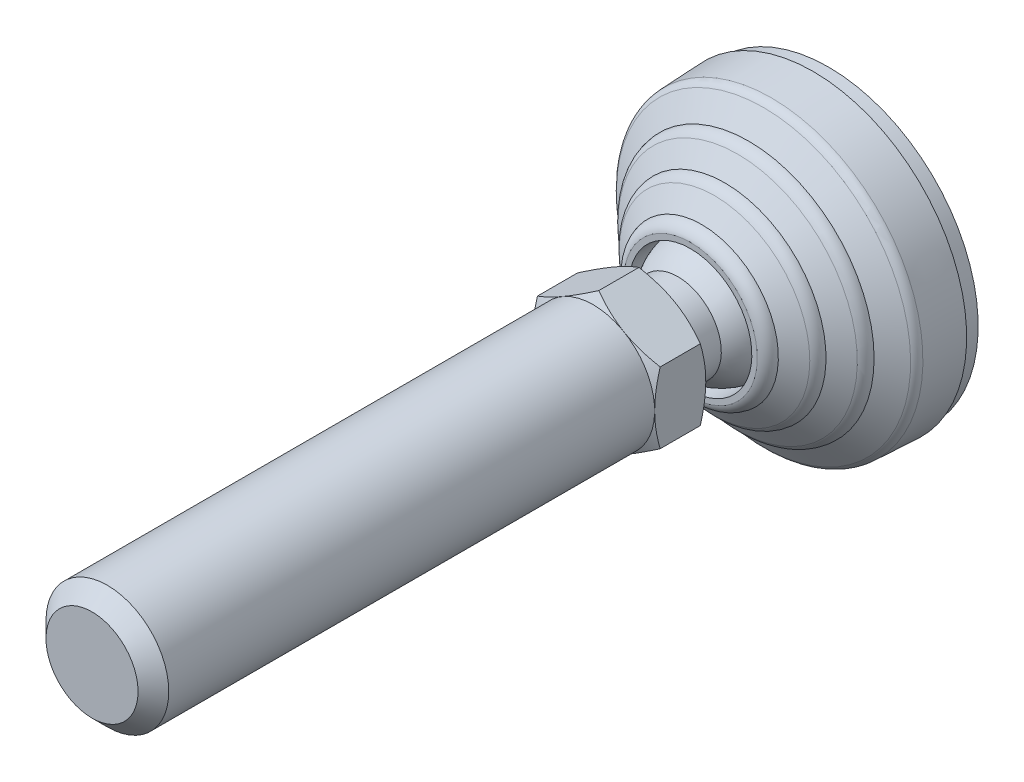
ISO-10303-21;
HEADER;
FILE_DESCRIPTION(('STEP AP214'),'2;1');
FILE_NAME('part.step','',(''),(''),'','','');
FILE_SCHEMA(('AUTOMOTIVE_DESIGN { 1 0 10303 214 1 1 1 1 }'));
ENDSEC;
DATA;
#1=APPLICATION_CONTEXT('core data for automotive mechanical design processes');
#2=APPLICATION_PROTOCOL_DEFINITION('international standard','automotive_design',2000,#1);
#3=PRODUCT_CONTEXT('',#1,'mechanical');
#4=PRODUCT('Part','Part','',(#3));
#5=PRODUCT_RELATED_PRODUCT_CATEGORY('part','',(#4));
#6=PRODUCT_DEFINITION_FORMATION('','',#4);
#7=PRODUCT_DEFINITION_CONTEXT('part definition',#1,'design');
#8=PRODUCT_DEFINITION('design','',#6,#7);
#9=PRODUCT_DEFINITION_SHAPE('','',#8);
#10=(LENGTH_UNIT() NAMED_UNIT(*) SI_UNIT(.MILLI.,.METRE.));
#11=(NAMED_UNIT(*) PLANE_ANGLE_UNIT() SI_UNIT($,.RADIAN.));
#12=(NAMED_UNIT(*) SI_UNIT($,.STERADIAN.) SOLID_ANGLE_UNIT());
#13=UNCERTAINTY_MEASURE_WITH_UNIT(LENGTH_MEASURE(1.E-05),#10,'distance_accuracy_value','');
#14=(GEOMETRIC_REPRESENTATION_CONTEXT(3) GLOBAL_UNCERTAINTY_ASSIGNED_CONTEXT((#13)) GLOBAL_UNIT_ASSIGNED_CONTEXT((#10,
#11,#12)) REPRESENTATION_CONTEXT('',''));
#15=CARTESIAN_POINT('',(0.,0.,0.));
#16=DIRECTION('',(0.,0.,1.));
#17=DIRECTION('',(1.,0.,0.));
#18=AXIS2_PLACEMENT_3D('',#15,#16,#17);
#19=CARTESIAN_POINT('',(0.,0.,93.1595));
#20=DIRECTION('',(0.,0.,-1.));
#21=DIRECTION('',(0.,1.,0.));
#22=AXIS2_PLACEMENT_3D('',#19,#20,#21);
#23=CYLINDRICAL_SURFACE('',#22,12.);
#24=CARTESIAN_POINT('',(0.,0.,141.));
#25=DIRECTION('',(0.,0.,1.));
#26=DIRECTION('',(0.,-1.,0.));
#27=AXIS2_PLACEMENT_3D('',#24,#25,#26);
#28=CIRCLE('',#27,12.);
#29=CARTESIAN_POINT('',(0.,-12.,141.));
#30=VERTEX_POINT('',#29);
#31=EDGE_CURVE('E9',#30,#30,#28,.F.);
#32=ORIENTED_EDGE('',*,*,#31,.T.);
#33=EDGE_LOOP('',(#32));
#34=FACE_BOUND('',#33,.T.);
#35=CARTESIAN_POINT('',(0.,0.,46.));
#36=DIRECTION('',(0.,0.,-1.));
#37=DIRECTION('',(0.,1.,0.));
#38=AXIS2_PLACEMENT_3D('',#35,#36,#37);
#39=CIRCLE('',#38,12.);
#40=CARTESIAN_POINT('',(0.,12.,46.));
#41=VERTEX_POINT('',#40);
#42=EDGE_CURVE('E124',#41,#41,#39,.F.);
#43=ORIENTED_EDGE('',*,*,#42,.T.);
#44=EDGE_LOOP('',(#43));
#45=FACE_BOUND('',#44,.T.);
#46=ADVANCED_FACE('F14',(#34,#45),#23,.T.);
#47=CARTESIAN_POINT('',(11.995,0.,46.));
#48=DIRECTION('',(0.,0.,-1.));
#49=DIRECTION('',(0.,1.,0.));
#50=AXIS2_PLACEMENT_3D('',#47,#48,#49);
#51=PLANE('',#50);
#52=CARTESIAN_POINT('',(0.,0.,46.));
#53=DIRECTION('',(0.,0.,-1.));
#54=DIRECTION('',(0.,1.,0.));
#55=AXIS2_PLACEMENT_3D('',#52,#53,#54);
#56=CIRCLE('',#55,11.99);
#57=CARTESIAN_POINT('',(0.,11.99,46.));
#58=VERTEX_POINT('',#57);
#59=EDGE_CURVE('E132',#58,#58,#56,.F.);
#60=ORIENTED_EDGE('',*,*,#59,.T.);
#61=EDGE_LOOP('',(#60));
#62=FACE_BOUND('',#61,.T.);
#63=ORIENTED_EDGE('',*,*,#42,.F.);
#64=EDGE_LOOP('',(#63));
#65=FACE_BOUND('',#64,.T.);
#66=ADVANCED_FACE('F157',(#62,#65),#51,.T.);
#67=CARTESIAN_POINT('',(0.,0.,44.9159643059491));
#68=DIRECTION('',(0.,0.,-1.));
#69=DIRECTION('',(0.,1.,0.));
#70=AXIS2_PLACEMENT_3D('',#67,#68,#69);
#71=CONICAL_SURFACE('',#70,13.8676048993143,1.0471975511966);
#72=ORIENTED_EDGE('',*,*,#59,.F.);
#73=EDGE_LOOP('',(#72));
#74=FACE_BOUND('',#73,.T.);
#75=CARTESIAN_POINT('',(-2.88482840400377E-08,-13.8564064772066,44.9224297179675));
#76=CARTESIAN_POINT('',(0.263784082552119,-13.7041106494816,45.010340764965));
#77=CARTESIAN_POINT('',(0.528551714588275,-13.5512469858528,45.0942615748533));
#78=CARTESIAN_POINT('',(1.06021019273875,-13.2442938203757,45.2530155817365));
#79=CARTESIAN_POINT('',(1.32710170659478,-13.0902039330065,45.3278457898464));
#80=CARTESIAN_POINT('',(2.13207647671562,-12.6254515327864,45.537252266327));
#81=CARTESIAN_POINT('',(2.67333741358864,-12.3129543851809,45.6563603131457));
#82=CARTESIAN_POINT('',(3.48330954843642,-11.8453167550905,45.796023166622));
#83=CARTESIAN_POINT('',(3.74960108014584,-11.6915732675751,45.8358073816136));
#84=CARTESIAN_POINT('',(4.28341699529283,-11.3833745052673,45.9025217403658));
#85=CARTESIAN_POINT('',(4.55094140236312,-11.2289192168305,45.9294516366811));
#86=CARTESIAN_POINT('',(5.08643614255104,-10.9197511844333,45.9697675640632));
#87=CARTESIAN_POINT('',(5.35440556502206,-10.7650389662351,45.9831696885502));
#88=CARTESIAN_POINT('',(5.8905925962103,-10.4554712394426,45.996144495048));
#89=CARTESIAN_POINT('',(6.15881019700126,-10.3006157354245,45.9957176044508));
#90=CARTESIAN_POINT('',(6.66023029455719,-10.0111207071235,45.9820002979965));
#91=CARTESIAN_POINT('',(6.89346857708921,-9.87646052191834,45.97038309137));
#92=CARTESIAN_POINT('',(7.35940867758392,-9.60744987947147,45.9369099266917));
#93=CARTESIAN_POINT('',(7.59211045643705,-9.47309944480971,45.9150532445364));
#94=CARTESIAN_POINT('',(8.05685109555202,-9.20478131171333,45.8614821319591));
#95=CARTESIAN_POINT('',(8.28888924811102,-9.07081402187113,45.8297595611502));
#96=CARTESIAN_POINT('',(8.75187776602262,-8.80350747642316,45.7570131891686));
#97=CARTESIAN_POINT('',(8.98282805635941,-8.67016826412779,45.7159887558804));
#98=CARTESIAN_POINT('',(9.68388987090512,-8.26541003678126,45.5779256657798));
#99=CARTESIAN_POINT('',(10.1519713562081,-7.99516306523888,45.4671213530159));
#100=CARTESIAN_POINT('',(11.081155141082,-7.45869855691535,45.2156417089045));
#101=CARTESIAN_POINT('',(11.5422693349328,-7.19247415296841,45.075025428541));
#102=CARTESIAN_POINT('',(11.9999999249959,-6.92820327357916,44.922429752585));
#103=B_SPLINE_CURVE_WITH_KNOTS('',3,(#75,#76,#77,#78,#79,#80,#81,#82,#83,#84,#85,#86,#87,#88,
#89,#90,#91,#92,#93,#94,#95,#96,#97,#98,#99,#100,#101,#102),.UNSPECIFIED.,.F.,.F.,(4,2,2,2,2,2,
2,2,2,2,2,2,2,4),(0.,0.950996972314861,1.90230578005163,3.80897261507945,4.73890631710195,
5.6688579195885,6.59770188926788,7.52651715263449,8.33503482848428,9.14360968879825,
9.95285348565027,10.7621522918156,12.4163368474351,14.0672749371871),.UNSPECIFIED.);
#104=CARTESIAN_POINT('',(-1.44241383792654E-08,-13.8564064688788,44.9224297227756));
#105=VERTEX_POINT('',#104);
#106=CARTESIAN_POINT('',(12.,-6.92820324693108,44.9224297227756));
#107=VERTEX_POINT('',#106);
#108=EDGE_CURVE('E143',#105,#107,#103,.T.);
#109=ORIENTED_EDGE('',*,*,#108,.T.);
#110=CARTESIAN_POINT('',(12.,-6.92820326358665,44.9224297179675));
#111=CARTESIAN_POINT('',(12.,-6.64374493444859,45.0045333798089));
#112=CARTESIAN_POINT('',(12.,-6.35829458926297,45.0831531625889));
#113=CARTESIAN_POINT('',(12.,-5.78524260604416,45.2325348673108));
#114=CARTESIAN_POINT('',(12.,-5.49764024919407,45.3032940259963));
#115=CARTESIAN_POINT('',(12.,-4.63053083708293,45.5026195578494));
#116=CARTESIAN_POINT('',(12.,-4.04782834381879,45.6179071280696));
#117=CARTESIAN_POINT('',(12.,-3.17548925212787,45.7575170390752));
#118=CARTESIAN_POINT('',(12.,-2.88840964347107,45.7982045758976));
#119=CARTESIAN_POINT('',(12.,-2.31290718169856,45.8685767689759));
#120=CARTESIAN_POINT('',(12.,-2.02448443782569,45.8982623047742));
#121=CARTESIAN_POINT('',(12.,-1.44696804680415,45.9459902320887));
#122=CARTESIAN_POINT('',(12.,-1.15787537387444,45.9640443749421));
#123=CARTESIAN_POINT('',(12.,-0.579188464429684,45.9881624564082));
#124=CARTESIAN_POINT('',(12.,-0.289594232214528,45.994226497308));
#125=CARTESIAN_POINT('',(12.,0.289594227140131,45.9942264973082));
#126=CARTESIAN_POINT('',(12.,0.579188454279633,45.9881624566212));
#127=CARTESIAN_POINT('',(12.,1.15787535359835,45.9640443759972));
#128=CARTESIAN_POINT('',(12.,1.44696802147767,45.9459902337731));
#129=CARTESIAN_POINT('',(12.,2.02448440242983,45.8982623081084));
#130=CARTESIAN_POINT('',(12.,2.31290714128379,45.8685767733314));
#131=CARTESIAN_POINT('',(12.,2.88840959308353,45.798204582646));
#132=CARTESIAN_POINT('',(12.,3.17548919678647,45.7575170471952));
#133=CARTESIAN_POINT('',(12.,4.04782827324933,45.6179071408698));
#134=CARTESIAN_POINT('',(12.,4.63053075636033,45.5026195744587));
#135=CARTESIAN_POINT('',(12.,5.49764015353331,45.3032940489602));
#136=CARTESIAN_POINT('',(12.,5.78524250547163,45.2325348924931));
#137=CARTESIAN_POINT('',(12.,6.35829447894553,45.0831531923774));
#138=CARTESIAN_POINT('',(12.,6.64374481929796,45.004533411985));
#139=CARTESIAN_POINT('',(12.,6.92820314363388,44.9224297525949));
#140=B_SPLINE_CURVE_WITH_KNOTS('',3,(#110,#111,#112,#113,#114,#115,#116,#117,#118,#119,#120,
#121,#122,#123,#124,#125,#126,#127,#128,#129,#130,#131,#132,#133,#134,#135,#136,#137,#138,#139),
.UNSPECIFIED.,.F.,.F.,(4,2,2,2,2,2,2,2,2,2,2,2,2,2,4),(0.,0.888148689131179,1.77660860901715,
3.55698615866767,4.42666281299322,5.2962699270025,6.16499708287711,7.03371682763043,
7.90243655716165,8.7711636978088,9.64077079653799,10.5104474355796,12.2908249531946,
13.1792848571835,14.0674335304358),.UNSPECIFIED.);
#141=CARTESIAN_POINT('',(12.0000000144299,6.92820322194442,44.9224297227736));
#142=VERTEX_POINT('',#141);
#143=EDGE_CURVE('E135',#107,#142,#140,.T.);
#144=ORIENTED_EDGE('',*,*,#143,.T.);
#145=CARTESIAN_POINT('',(12.0000000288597,6.92820321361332,44.9224297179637));
#146=CARTESIAN_POINT('',(11.7362159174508,7.08049904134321,45.0103407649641));
#147=CARTESIAN_POINT('',(11.4714482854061,7.23336270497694,45.0942615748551));
#148=CARTESIAN_POINT('',(10.9397898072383,7.54031587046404,45.2530155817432));
#149=CARTESIAN_POINT('',(10.6728982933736,7.69440575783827,45.3278457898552));
#150=CARTESIAN_POINT('',(9.86792352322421,8.15915815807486,45.5372522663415));
#151=CARTESIAN_POINT('',(9.32666258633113,8.47165530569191,45.6563603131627));
#152=CARTESIAN_POINT('',(8.51669045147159,8.93929293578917,45.7960231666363));
#153=CARTESIAN_POINT('',(8.25039891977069,9.0930364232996,45.8358073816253));
#154=CARTESIAN_POINT('',(7.71658300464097,9.40123518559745,45.9025217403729));
#155=CARTESIAN_POINT('',(7.44905859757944,9.55569047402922,45.9294516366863));
#156=CARTESIAN_POINT('',(6.91356385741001,9.86485850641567,45.9697675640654));
#157=CARTESIAN_POINT('',(6.64559443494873,10.0195707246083,45.9831696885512));
#158=CARTESIAN_POINT('',(6.10940740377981,10.3291384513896,45.996144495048));
#159=CARTESIAN_POINT('',(5.84118980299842,10.4839939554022,45.9957176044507));
#160=CARTESIAN_POINT('',(5.33976970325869,10.773488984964,45.9820002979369));
#161=CARTESIAN_POINT('',(5.10653141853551,10.9081491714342,45.970383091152));
#162=CARTESIAN_POINT('',(4.64059131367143,11.1771598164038,45.9369099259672));
#163=CARTESIAN_POINT('',(4.4078895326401,11.3115102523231,45.9150532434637));
#164=CARTESIAN_POINT('',(3.94314888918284,11.5798283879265,45.8614821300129));
#165=CARTESIAN_POINT('',(3.71111073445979,11.7137956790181,45.8297595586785));
#166=CARTESIAN_POINT('',(3.24812221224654,11.9811022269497,45.7570131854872));
#167=CARTESIAN_POINT('',(3.01717191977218,12.1144414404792,45.7159887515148));
#168=CARTESIAN_POINT('',(2.31611009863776,12.5191996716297,45.5779256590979));
#169=CARTESIAN_POINT('',(1.84802860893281,12.7894466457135,45.4671213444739));
#170=CARTESIAN_POINT('',(0.918844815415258,13.3259111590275,45.2156416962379));
#171=CARTESIAN_POINT('',(0.457730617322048,13.5921355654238,45.0750254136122));
#172=CARTESIAN_POINT('',(2.30778996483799E-08,13.856406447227,44.9224297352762));
#173=B_SPLINE_CURVE_WITH_KNOTS('',3,(#145,#146,#147,#148,#149,#150,#151,#152,#153,#154,#155,
#156,#157,#158,#159,#160,#161,#162,#163,#164,#165,#166,#167,#168,#169,#170,#171,#172),
.UNSPECIFIED.,.F.,.F.,(4,2,2,2,2,2,2,2,2,2,2,2,2,4),(0.,0.95099697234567,1.9023057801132,
3.8089726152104,4.73890631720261,5.66885791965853,6.59770188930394,7.52651715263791,
8.33503483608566,9.14360970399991,9.95285350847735,10.7621523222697,12.4163368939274,
14.0672749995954),.UNSPECIFIED.);
#174=CARTESIAN_POINT('',(-1.15389586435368E-08,13.856406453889,44.92242973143));
#175=VERTEX_POINT('',#174);
#176=EDGE_CURVE('E181',#142,#175,#173,.T.);
#177=ORIENTED_EDGE('',*,*,#176,.T.);
#178=CARTESIAN_POINT('',(-2.30779106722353E-08,13.856406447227,44.9224297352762));
#179=CARTESIAN_POINT('',(-0.263784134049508,13.7041106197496,45.0103407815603));
#180=CARTESIAN_POINT('',(-0.528551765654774,13.5512469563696,45.0942615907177));
#181=CARTESIAN_POINT('',(-1.06021024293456,13.2442937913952,45.2530155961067));
#182=CARTESIAN_POINT('',(-1.32710175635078,13.0902039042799,45.3278458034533));
#183=CARTESIAN_POINT('',(-2.13207652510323,12.6254515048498,45.5372522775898));
#184=CARTESIAN_POINT('',(-2.67333746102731,12.3129543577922,45.656360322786));
#185=CARTESIAN_POINT('',(-3.48330959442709,11.8453167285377,45.7960231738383));
#186=CARTESIAN_POINT('',(-3.74960112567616,11.6915732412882,45.8358073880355));
#187=CARTESIAN_POINT('',(-4.28341703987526,11.3833744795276,45.9025217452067));
#188=CARTESIAN_POINT('',(-4.55094144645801,11.2289191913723,45.9294516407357));
#189=CARTESIAN_POINT('',(-5.08643618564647,10.9197511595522,45.9697675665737));
#190=CARTESIAN_POINT('',(-5.35440560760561,10.7650389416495,45.9831696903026));
#191=CARTESIAN_POINT('',(-5.89059263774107,10.4554712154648,45.9961444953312));
#192=CARTESIAN_POINT('',(-6.15881023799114,10.300615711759,45.9957176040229));
#193=CARTESIAN_POINT('',(-6.66023033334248,10.0111206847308,45.9820002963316));
#194=CARTESIAN_POINT('',(-6.89346861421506,9.87646050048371,45.9703830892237));
#195=CARTESIAN_POINT('',(-7.35940871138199,9.60744985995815,45.9369099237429));
#196=CARTESIAN_POINT('',(-7.59211048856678,9.4730994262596,45.9150532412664));
#197=CARTESIAN_POINT('',(-8.05685112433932,9.20478129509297,45.8614821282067));
#198=CARTESIAN_POINT('',(-8.28888927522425,9.0708140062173,45.8297595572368));
#199=CARTESIAN_POINT('',(-8.75187778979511,8.8035074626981,45.7570131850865));
#200=CARTESIAN_POINT('',(-8.98282807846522,8.67016825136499,45.7159887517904));
#201=CARTESIAN_POINT('',(-9.68388988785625,8.26541002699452,45.5779256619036));
#202=CARTESIAN_POINT('',(-10.1519713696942,7.9951630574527,45.4671213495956));
#203=CARTESIAN_POINT('',(-11.0811551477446,7.45869855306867,45.2156417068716));
#204=CARTESIAN_POINT('',(-11.5422693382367,7.19247415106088,45.0750254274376));
#205=CARTESIAN_POINT('',(-11.9999999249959,6.92820327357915,44.922429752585));
#206=B_SPLINE_CURVE_WITH_KNOTS('',3,(#178,#179,#180,#181,#182,#183,#184,#185,#186,#187,#188,
#189,#190,#191,#192,#193,#194,#195,#196,#197,#198,#199,#200,#201,#202,#203,#204,#205),
.UNSPECIFIED.,.F.,.F.,(4,2,2,2,2,2,2,2,2,2,2,2,2,4),(0.,0.9509969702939,1.90230577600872,
3.80897260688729,4.73890630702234,5.6688579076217,6.5977018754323,7.52651713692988,
8.33503480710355,9.14360966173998,9.95285345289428,10.7621522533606,12.4163367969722,
14.067274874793),.UNSPECIFIED.);
#207=CARTESIAN_POINT('',(-12.,6.92820324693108,44.9224297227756));
#208=VERTEX_POINT('',#207);
#209=EDGE_CURVE('E173',#175,#208,#206,.T.);
#210=ORIENTED_EDGE('',*,*,#209,.T.);
#211=CARTESIAN_POINT('',(-12.,6.92820326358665,44.9224297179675));
#212=CARTESIAN_POINT('',(-12.,6.64374493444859,45.0045333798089));
#213=CARTESIAN_POINT('',(-12.,6.35829458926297,45.0831531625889));
#214=CARTESIAN_POINT('',(-12.,5.78524260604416,45.2325348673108));
#215=CARTESIAN_POINT('',(-12.,5.49764024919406,45.3032940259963));
#216=CARTESIAN_POINT('',(-12.,4.63053083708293,45.5026195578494));
#217=CARTESIAN_POINT('',(-12.,4.04782834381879,45.6179071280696));
#218=CARTESIAN_POINT('',(-12.,3.17548925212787,45.7575170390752));
#219=CARTESIAN_POINT('',(-12.,2.88840964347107,45.7982045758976));
#220=CARTESIAN_POINT('',(-12.,2.31290718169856,45.8685767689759));
#221=CARTESIAN_POINT('',(-12.,2.02448443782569,45.8982623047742));
#222=CARTESIAN_POINT('',(-12.,1.44696804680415,45.9459902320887));
#223=CARTESIAN_POINT('',(-12.,1.15787537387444,45.9640443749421));
#224=CARTESIAN_POINT('',(-12.,0.579188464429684,45.9881624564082));
#225=CARTESIAN_POINT('',(-12.,0.289594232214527,45.994226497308));
#226=CARTESIAN_POINT('',(-12.,-0.289594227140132,45.9942264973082));
#227=CARTESIAN_POINT('',(-12.,-0.579188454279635,45.9881624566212));
#228=CARTESIAN_POINT('',(-12.,-1.15787535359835,45.9640443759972));
#229=CARTESIAN_POINT('',(-12.,-1.44696802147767,45.9459902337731));
#230=CARTESIAN_POINT('',(-12.,-2.02448440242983,45.8982623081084));
#231=CARTESIAN_POINT('',(-12.,-2.31290714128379,45.8685767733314));
#232=CARTESIAN_POINT('',(-12.,-2.88840959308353,45.798204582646));
#233=CARTESIAN_POINT('',(-12.,-3.17548919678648,45.7575170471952));
#234=CARTESIAN_POINT('',(-12.,-4.04782827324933,45.6179071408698));
#235=CARTESIAN_POINT('',(-12.,-4.63053075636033,45.5026195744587));
#236=CARTESIAN_POINT('',(-12.,-5.49764015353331,45.3032940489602));
#237=CARTESIAN_POINT('',(-12.,-5.78524250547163,45.2325348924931));
#238=CARTESIAN_POINT('',(-12.,-6.35829447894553,45.0831531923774));
#239=CARTESIAN_POINT('',(-12.,-6.64374481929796,45.004533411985));
#240=CARTESIAN_POINT('',(-12.,-6.92820314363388,44.9224297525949));
#241=B_SPLINE_CURVE_WITH_KNOTS('',3,(#211,#212,#213,#214,#215,#216,#217,#218,#219,#220,#221,
#222,#223,#224,#225,#226,#227,#228,#229,#230,#231,#232,#233,#234,#235,#236,#237,#238,#239,#240),
.UNSPECIFIED.,.F.,.F.,(4,2,2,2,2,2,2,2,2,2,2,2,2,2,4),(0.,0.888148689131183,1.77660860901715,
3.55698615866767,4.42666281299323,5.2962699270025,6.16499708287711,7.03371682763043,
7.90243655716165,8.7711636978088,9.64077079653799,10.5104474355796,12.2908249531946,
13.1792848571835,14.0674335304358),.UNSPECIFIED.);
#242=CARTESIAN_POINT('',(-12.0000000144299,-6.92820322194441,44.9224297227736));
#243=VERTEX_POINT('',#242);
#244=EDGE_CURVE('E350',#208,#243,#241,.T.);
#245=ORIENTED_EDGE('',*,*,#244,.T.);
#246=CARTESIAN_POINT('',(-12.0000000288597,-6.92820321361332,44.9224297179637));
#247=CARTESIAN_POINT('',(-11.7362159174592,-7.08049904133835,45.0103407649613));
#248=CARTESIAN_POINT('',(-11.471448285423,-7.23336270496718,45.0942615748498));
#249=CARTESIAN_POINT('',(-10.9397898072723,-7.54031587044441,45.2530155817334));
#250=CARTESIAN_POINT('',(-10.6728982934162,-7.69440575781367,45.3278457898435));
#251=CARTESIAN_POINT('',(-9.86792352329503,-8.15915815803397,45.5372522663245));
#252=CARTESIAN_POINT('',(-9.32666258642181,-8.47165530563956,45.6563603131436));
#253=CARTESIAN_POINT('',(-8.51669045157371,-8.93929293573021,45.7960231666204));
#254=CARTESIAN_POINT('',(-8.25039891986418,-9.09303642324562,45.8358073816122));
#255=CARTESIAN_POINT('',(-7.71658300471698,-9.40123518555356,45.9025217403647));
#256=CARTESIAN_POINT('',(-7.44905859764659,-9.55569047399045,45.9294516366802));
#257=CARTESIAN_POINT('',(-6.91356385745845,-9.8648585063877,45.9697675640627));
#258=CARTESIAN_POINT('',(-6.64559443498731,-10.019570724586,45.9831696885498));
#259=CARTESIAN_POINT('',(-6.10940740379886,-10.3291384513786,45.996144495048));
#260=CARTESIAN_POINT('',(-5.84118980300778,-10.4839939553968,45.9957176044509));
#261=CARTESIAN_POINT('',(-5.33976970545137,-10.7734889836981,45.9820002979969));
#262=CARTESIAN_POINT('',(-5.10653142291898,-10.9081491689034,45.9703830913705));
#263=CARTESIAN_POINT('',(-4.64059132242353,-11.1771598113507,45.9369099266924));
#264=CARTESIAN_POINT('',(-4.40788954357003,-11.3115102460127,45.9150532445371));
#265=CARTESIAN_POINT('',(-3.94314890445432,-11.5798283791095,45.8614821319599));
#266=CARTESIAN_POINT('',(-3.71111075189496,-11.7137956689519,45.8297595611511));
#267=CARTESIAN_POINT('',(-3.24812223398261,-11.9811022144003,45.7570131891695));
#268=CARTESIAN_POINT('',(-3.01717194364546,-12.1144414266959,45.7159887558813));
#269=CARTESIAN_POINT('',(-2.3161101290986,-12.5191996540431,45.5779256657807));
#270=CARTESIAN_POINT('',(-1.84802864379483,-12.7894466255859,45.4671213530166));
#271=CARTESIAN_POINT('',(-0.918844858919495,-13.3259111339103,45.215641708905));
#272=CARTESIAN_POINT('',(-0.457730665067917,-13.5921355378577,45.0750254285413));
#273=CARTESIAN_POINT('',(-7.50040968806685E-08,-13.8564064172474,44.922429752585));
#274=B_SPLINE_CURVE_WITH_KNOTS('',3,(#246,#247,#248,#249,#250,#251,#252,#253,#254,#255,#256,
#257,#258,#259,#260,#261,#262,#263,#264,#265,#266,#267,#268,#269,#270,#271,#272,#273),
.UNSPECIFIED.,.F.,.F.,(4,2,2,2,2,2,2,2,2,2,2,2,2,4),(0.,0.950996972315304,1.90230578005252,
3.80897261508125,4.73890631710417,5.66885791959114,6.59770188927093,7.52651715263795,
8.33503482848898,9.14360968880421,9.95285348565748,10.7621522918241,12.4163368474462,
14.0672749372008),.UNSPECIFIED.);
#275=EDGE_CURVE('E163',#243,#105,#274,.T.);
#276=ORIENTED_EDGE('',*,*,#275,.T.);
#277=EDGE_LOOP('',(#109,#144,#177,#210,#245,#276));
#278=FACE_BOUND('',#277,.T.);
#279=ADVANCED_FACE('F152',(#74,#278),#71,.T.);
#280=CARTESIAN_POINT('',(0.,-13.856406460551,46.1));
#281=DIRECTION('',(0.5,0.866025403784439,0.));
#282=DIRECTION('',(-0.866025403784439,0.5,0.));
#283=AXIS2_PLACEMENT_3D('',#280,#281,#282);
#284=PLANE('',#283);
#285=DIRECTION('',(0.,0.,1.));
#286=VECTOR('',#285,1.);
#287=CARTESIAN_POINT('',(0.,-13.856406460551,46.1));
#288=LINE('',#287,#286);
#289=CARTESIAN_POINT('',(0.,-13.856406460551,37.0775702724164));
#290=VERTEX_POINT('',#289);
#291=EDGE_CURVE('E376',#290,#105,#288,.T.);
#292=ORIENTED_EDGE('',*,*,#291,.T.);
#293=ORIENTED_EDGE('',*,*,#275,.F.);
#294=DIRECTION('',(0.,0.,1.));
#295=VECTOR('',#294,1.);
#296=CARTESIAN_POINT('',(-12.,-6.9282032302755,46.1));
#297=LINE('',#296,#295);
#298=CARTESIAN_POINT('',(-12.,-6.9282032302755,37.0775702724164));
#299=VERTEX_POINT('',#298);
#300=EDGE_CURVE('E368',#299,#243,#297,.T.);
#301=ORIENTED_EDGE('',*,*,#300,.F.);
#302=CARTESIAN_POINT('',(0.,-13.856406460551,37.0775702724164));
#303=CARTESIAN_POINT('',(-0.263784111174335,-13.7041106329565,36.9896592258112));
#304=CARTESIAN_POINT('',(-0.528551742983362,-13.5512469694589,36.9057384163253));
#305=CARTESIAN_POINT('',(-1.0602102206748,-13.2442938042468,36.7469844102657));
#306=CARTESIAN_POINT('',(-1.32710173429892,-13.0902039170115,36.6721542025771));
#307=CARTESIAN_POINT('',(-2.13207650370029,-12.6254515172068,36.4627477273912));
#308=CARTESIAN_POINT('',(-2.67333744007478,-12.3129543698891,36.3436396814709));
#309=CARTESIAN_POINT('',(-3.48330957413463,-11.8453167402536,36.2039768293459));
#310=CARTESIAN_POINT('',(-3.74960110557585,-11.6915732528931,36.1641926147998));
#311=CARTESIAN_POINT('',(-4.28341702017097,-11.3833744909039,36.097478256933));
#312=CARTESIAN_POINT('',(-4.55094142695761,-11.2289192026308,36.0705483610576));
#313=CARTESIAN_POINT('',(-5.08643616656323,-10.9197511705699,36.0302324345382));
#314=CARTESIAN_POINT('',(-5.35440558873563,-10.765038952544,36.0168303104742));
#315=CARTESIAN_POINT('',(-5.89059261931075,-10.4554712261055,36.0038555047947));
#316=CARTESIAN_POINT('',(-6.15881021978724,-10.300615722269,36.0042823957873));
#317=CARTESIAN_POINT('',(-6.66023031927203,-10.0111206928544,36.0179997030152));
#318=CARTESIAN_POINT('',(-6.8934686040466,-9.87646050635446,36.029616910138));
#319=CARTESIAN_POINT('',(-7.35940870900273,-9.6074498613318,36.063090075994));
#320=CARTESIAN_POINT('',(-7.59211049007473,-9.47309942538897,36.0849467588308));
#321=CARTESIAN_POINT('',(-8.05685113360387,-9.20478128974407,36.1385178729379));
#322=CARTESIAN_POINT('',(-8.28888928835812,-9.07081399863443,36.1702404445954));
#323=CARTESIAN_POINT('',(-8.75187781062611,-8.8035074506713,36.2429868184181));
#324=CARTESIAN_POINT('',(-8.98282810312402,-8.67016823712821,36.2840112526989));
#325=CARTESIAN_POINT('',(-9.6838899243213,-8.2654100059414,36.4220743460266));
#326=CARTESIAN_POINT('',(-10.1519714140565,-7.99516303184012,36.5328786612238));
#327=CARTESIAN_POINT('',(-11.0811552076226,-7.45869851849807,36.7843583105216));
#328=CARTESIAN_POINT('',(-11.5422694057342,-7.19247411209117,36.924974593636));
#329=CARTESIAN_POINT('',(-12.,-6.9282032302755,37.0775702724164));
#330=B_SPLINE_CURVE_WITH_KNOTS('',3,(#302,#303,#304,#305,#306,#307,#308,#309,#310,#311,#312,
#313,#314,#315,#316,#317,#318,#319,#320,#321,#322,#323,#324,#325,#326,#327,#328,#329),
.UNSPECIFIED.,.F.,.F.,(4,2,2,2,2,2,2,2,2,2,2,2,2,4),(0.,0.950996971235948,1.90230577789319,
3.80897261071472,4.73890631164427,5.66885791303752,6.59770188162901,7.52651714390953,
8.33503482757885,9.14360969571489,9.9528535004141,10.7621523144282,12.4163368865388,
14.0672749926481),.UNSPECIFIED.);
#331=EDGE_CURVE('E370',#290,#299,#330,.T.);
#332=ORIENTED_EDGE('',*,*,#331,.F.);
#333=EDGE_LOOP('',(#292,#293,#301,#332));
#334=FACE_BOUND('',#333,.T.);
#335=ADVANCED_FACE('F156',(#334),#284,.F.);
#336=CARTESIAN_POINT('',(12.,-6.92820323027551,46.1));
#337=DIRECTION('',(-0.5,0.866025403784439,0.));
#338=DIRECTION('',(-0.866025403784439,-0.5,0.));
#339=AXIS2_PLACEMENT_3D('',#336,#337,#338);
#340=PLANE('',#339);
#341=DIRECTION('',(0.,0.,1.));
#342=VECTOR('',#341,1.);
#343=CARTESIAN_POINT('',(12.,-6.92820323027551,46.1));
#344=LINE('',#343,#342);
#345=CARTESIAN_POINT('',(12.,-6.92820323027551,37.0775702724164));
#346=VERTEX_POINT('',#345);
#347=EDGE_CURVE('E31',#346,#107,#344,.T.);
#348=ORIENTED_EDGE('',*,*,#347,.T.);
#349=ORIENTED_EDGE('',*,*,#108,.F.);
#350=ORIENTED_EDGE('',*,*,#291,.F.);
#351=CARTESIAN_POINT('',(12.,-6.92820323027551,37.0775702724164));
#352=CARTESIAN_POINT('',(11.7362158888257,-7.08049905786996,36.9896592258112));
#353=CARTESIAN_POINT('',(11.4714482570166,-7.2333627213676,36.9057384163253));
#354=CARTESIAN_POINT('',(10.9397897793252,-7.5403158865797,36.7469844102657));
#355=CARTESIAN_POINT('',(10.6728982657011,-7.69440577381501,36.6721542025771));
#356=CARTESIAN_POINT('',(9.86792349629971,-8.15915817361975,36.4627477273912));
#357=CARTESIAN_POINT('',(9.32666255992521,-8.4716553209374,36.3436396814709));
#358=CARTESIAN_POINT('',(8.51669042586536,-8.93929295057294,36.2039768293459));
#359=CARTESIAN_POINT('',(8.25039889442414,-9.09303643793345,36.1641926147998));
#360=CARTESIAN_POINT('',(7.71658297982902,-9.40123519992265,36.097478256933));
#361=CARTESIAN_POINT('',(7.44905857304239,-9.55569048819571,36.0705483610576));
#362=CARTESIAN_POINT('',(6.91356383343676,-9.86485852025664,36.0302324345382));
#363=CARTESIAN_POINT('',(6.64559441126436,-10.0195707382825,36.0168303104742));
#364=CARTESIAN_POINT('',(6.10940738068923,-10.329138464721,36.0038555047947));
#365=CARTESIAN_POINT('',(5.84118978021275,-10.4839939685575,36.0042823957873));
#366=CARTESIAN_POINT('',(5.33976968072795,-10.7734889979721,36.0179997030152));
#367=CARTESIAN_POINT('',(5.10653139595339,-10.9081491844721,36.029616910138));
#368=CARTESIAN_POINT('',(4.64059129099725,-11.1771598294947,36.063090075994));
#369=CARTESIAN_POINT('',(4.40788950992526,-11.3115102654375,36.0849467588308));
#370=CARTESIAN_POINT('',(3.94314886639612,-11.5798284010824,36.1385178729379));
#371=CARTESIAN_POINT('',(3.71111071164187,-11.7137956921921,36.1702404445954));
#372=CARTESIAN_POINT('',(3.24812218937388,-11.9811022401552,36.2429868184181));
#373=CARTESIAN_POINT('',(3.01717189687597,-12.1144414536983,36.2840112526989));
#374=CARTESIAN_POINT('',(2.3161100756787,-12.5191996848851,36.4220743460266));
#375=CARTESIAN_POINT('',(1.84802858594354,-12.7894466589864,36.5328786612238));
#376=CARTESIAN_POINT('',(0.918844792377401,-13.3259111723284,36.7843583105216));
#377=CARTESIAN_POINT('',(0.457730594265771,-13.5921355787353,36.924974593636));
#378=CARTESIAN_POINT('',(0.,-13.856406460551,37.0775702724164));
#379=B_SPLINE_CURVE_WITH_KNOTS('',3,(#351,#352,#353,#354,#355,#356,#357,#358,#359,#360,#361,
#362,#363,#364,#365,#366,#367,#368,#369,#370,#371,#372,#373,#374,#375,#376,#377,#378),
.UNSPECIFIED.,.F.,.F.,(4,2,2,2,2,2,2,2,2,2,2,2,2,4),(0.,0.95099697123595,1.90230577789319,
3.80897261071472,4.73890631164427,5.66885791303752,6.59770188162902,7.52651714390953,
8.33503482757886,9.14360969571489,9.9528535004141,10.7621523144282,12.4163368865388,
14.0672749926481),.UNSPECIFIED.);
#380=EDGE_CURVE('E377',#346,#290,#379,.T.);
#381=ORIENTED_EDGE('',*,*,#380,.F.);
#382=EDGE_LOOP('',(#348,#349,#350,#381));
#383=FACE_BOUND('',#382,.T.);
#384=ADVANCED_FACE('F383',(#383),#340,.F.);
#385=CARTESIAN_POINT('',(-12.,6.92820323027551,46.1));
#386=DIRECTION('',(0.5,-0.866025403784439,0.));
#387=DIRECTION('',(0.866025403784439,0.5,0.));
#388=AXIS2_PLACEMENT_3D('',#385,#386,#387);
#389=PLANE('',#388);
#390=DIRECTION('',(0.,0.,1.));
#391=VECTOR('',#390,1.);
#392=CARTESIAN_POINT('',(-12.,6.92820323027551,46.1));
#393=LINE('',#392,#391);
#394=CARTESIAN_POINT('',(-12.,6.92820323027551,37.0775702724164));
#395=VERTEX_POINT('',#394);
#396=EDGE_CURVE('E369',#395,#208,#393,.T.);
#397=ORIENTED_EDGE('',*,*,#396,.T.);
#398=ORIENTED_EDGE('',*,*,#209,.F.);
#399=DIRECTION('',(0.,0.,1.));
#400=VECTOR('',#399,1.);
#401=CARTESIAN_POINT('',(0.,13.856406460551,46.1));
#402=LINE('',#401,#400);
#403=CARTESIAN_POINT('',(0.,13.856406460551,37.0775702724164));
#404=VERTEX_POINT('',#403);
#405=EDGE_CURVE('E212',#404,#175,#402,.T.);
#406=ORIENTED_EDGE('',*,*,#405,.F.);
#407=CARTESIAN_POINT('',(-12.,6.92820323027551,37.0775702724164));
#408=CARTESIAN_POINT('',(-11.7362158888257,7.08049905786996,36.9896592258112));
#409=CARTESIAN_POINT('',(-11.4714482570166,7.2333627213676,36.9057384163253));
#410=CARTESIAN_POINT('',(-10.9397897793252,7.5403158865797,36.7469844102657));
#411=CARTESIAN_POINT('',(-10.6728982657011,7.69440577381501,36.6721542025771));
#412=CARTESIAN_POINT('',(-9.86792349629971,8.15915817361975,36.4627477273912));
#413=CARTESIAN_POINT('',(-9.32666255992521,8.4716553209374,36.3436396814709));
#414=CARTESIAN_POINT('',(-8.51669042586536,8.93929295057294,36.2039768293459));
#415=CARTESIAN_POINT('',(-8.25039889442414,9.09303643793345,36.1641926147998));
#416=CARTESIAN_POINT('',(-7.71658297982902,9.40123519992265,36.097478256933));
#417=CARTESIAN_POINT('',(-7.44905857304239,9.55569048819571,36.0705483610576));
#418=CARTESIAN_POINT('',(-6.91356383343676,9.86485852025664,36.0302324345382));
#419=CARTESIAN_POINT('',(-6.64559441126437,10.0195707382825,36.0168303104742));
#420=CARTESIAN_POINT('',(-6.10940738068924,10.329138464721,36.0038555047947));
#421=CARTESIAN_POINT('',(-5.84118978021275,10.4839939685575,36.0042823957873));
#422=CARTESIAN_POINT('',(-5.33976968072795,10.7734889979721,36.0179997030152));
#423=CARTESIAN_POINT('',(-5.10653139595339,10.9081491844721,36.029616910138));
#424=CARTESIAN_POINT('',(-4.64059129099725,11.1771598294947,36.063090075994));
#425=CARTESIAN_POINT('',(-4.40788950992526,11.3115102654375,36.0849467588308));
#426=CARTESIAN_POINT('',(-3.94314886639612,11.5798284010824,36.1385178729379));
#427=CARTESIAN_POINT('',(-3.71111071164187,11.7137956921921,36.1702404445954));
#428=CARTESIAN_POINT('',(-3.24812218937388,11.9811022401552,36.2429868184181));
#429=CARTESIAN_POINT('',(-3.01717189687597,12.1144414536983,36.2840112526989));
#430=CARTESIAN_POINT('',(-2.3161100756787,12.5191996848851,36.4220743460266));
#431=CARTESIAN_POINT('',(-1.84802858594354,12.7894466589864,36.5328786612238));
#432=CARTESIAN_POINT('',(-0.918844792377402,13.3259111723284,36.7843583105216));
#433=CARTESIAN_POINT('',(-0.457730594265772,13.5921355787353,36.924974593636));
#434=CARTESIAN_POINT('',(0.,13.856406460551,37.0775702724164));
#435=B_SPLINE_CURVE_WITH_KNOTS('',3,(#407,#408,#409,#410,#411,#412,#413,#414,#415,#416,#417,
#418,#419,#420,#421,#422,#423,#424,#425,#426,#427,#428,#429,#430,#431,#432,#433,#434),
.UNSPECIFIED.,.F.,.F.,(4,2,2,2,2,2,2,2,2,2,2,2,2,4),(0.,0.95099697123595,1.90230577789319,
3.80897261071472,4.73890631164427,5.66885791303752,6.59770188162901,7.52651714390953,
8.33503482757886,9.14360969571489,9.9528535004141,10.7621523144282,12.4163368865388,
14.0672749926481),.UNSPECIFIED.);
#436=EDGE_CURVE('E214',#395,#404,#435,.T.);
#437=ORIENTED_EDGE('',*,*,#436,.F.);
#438=EDGE_LOOP('',(#397,#398,#406,#437));
#439=FACE_BOUND('',#438,.T.);
#440=ADVANCED_FACE('F200',(#439),#389,.F.);
#441=CARTESIAN_POINT('',(-12.,-6.92820323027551,46.1));
#442=DIRECTION('',(1.,0.,0.));
#443=DIRECTION('',(0.,1.,0.));
#444=AXIS2_PLACEMENT_3D('',#441,#442,#443);
#445=PLANE('',#444);
#446=ORIENTED_EDGE('',*,*,#300,.T.);
#447=ORIENTED_EDGE('',*,*,#244,.F.);
#448=ORIENTED_EDGE('',*,*,#396,.F.);
#449=CARTESIAN_POINT('',(-12.,-6.9282032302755,37.0775702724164));
#450=CARTESIAN_POINT('',(-12.,-6.64374490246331,36.9954666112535));
#451=CARTESIAN_POINT('',(-12.,-6.35829455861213,36.9168468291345));
#452=CARTESIAN_POINT('',(-12.,-5.78524257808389,36.7674651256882));
#453=CARTESIAN_POINT('',(-12.,-5.49764022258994,36.6967059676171));
#454=CARTESIAN_POINT('',(-12.,-4.63053081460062,36.4973804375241));
#455=CARTESIAN_POINT('',(-12.,-4.04782832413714,36.3820928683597));
#456=CARTESIAN_POINT('',(-12.,-3.17548923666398,36.2424829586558));
#457=CARTESIAN_POINT('',(-12.,-2.88840962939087,36.2017954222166));
#458=CARTESIAN_POINT('',(-12.,-2.31290717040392,36.1314232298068));
#459=CARTESIAN_POINT('',(-12.,-2.02448442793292,36.1017376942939));
#460=CARTESIAN_POINT('',(-12.,-1.44696803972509,36.0540097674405));
#461=CARTESIAN_POINT('',(-12.,-1.1578753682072,36.035955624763));
#462=CARTESIAN_POINT('',(-12.,-0.579188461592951,36.0118375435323));
#463=CARTESIAN_POINT('',(-12.,-0.289594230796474,36.0057735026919));
#464=CARTESIAN_POINT('',(-12.,0.28959423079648,36.0057735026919));
#465=CARTESIAN_POINT('',(-12.,0.579188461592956,36.0118375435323));
#466=CARTESIAN_POINT('',(-12.,1.15787536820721,36.035955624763));
#467=CARTESIAN_POINT('',(-12.,1.4469680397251,36.0540097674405));
#468=CARTESIAN_POINT('',(-12.,2.02448442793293,36.1017376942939));
#469=CARTESIAN_POINT('',(-12.,2.31290717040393,36.1314232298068));
#470=CARTESIAN_POINT('',(-12.,2.88840962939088,36.2017954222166));
#471=CARTESIAN_POINT('',(-12.,3.17548923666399,36.2424829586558));
#472=CARTESIAN_POINT('',(-12.,4.04782832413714,36.3820928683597));
#473=CARTESIAN_POINT('',(-12.,4.63053081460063,36.4973804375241));
#474=CARTESIAN_POINT('',(-12.,5.49764022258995,36.6967059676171));
#475=CARTESIAN_POINT('',(-12.,5.7852425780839,36.7674651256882));
#476=CARTESIAN_POINT('',(-12.,6.35829455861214,36.9168468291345));
#477=CARTESIAN_POINT('',(-12.,6.64374490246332,36.9954666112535));
#478=CARTESIAN_POINT('',(-12.,6.92820323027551,37.0775702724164));
#479=B_SPLINE_CURVE_WITH_KNOTS('',3,(#449,#450,#451,#452,#453,#454,#455,#456,#457,#458,#459,
#460,#461,#462,#463,#464,#465,#466,#467,#468,#469,#470,#471,#472,#473,#474,#475,#476,#477,#478),
.UNSPECIFIED.,.F.,.F.,(4,2,2,2,2,2,2,2,2,2,2,2,2,2,4),(0.,0.888148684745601,1.77660860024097,
3.55698614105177,4.42666279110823,5.29626990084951,6.16499705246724,7.03371679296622,
7.90243653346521,8.77116368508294,9.64077079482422,10.5104474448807,12.2908249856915,
13.1792849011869,14.0674335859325),.UNSPECIFIED.);
#480=EDGE_CURVE('E362',#299,#395,#479,.T.);
#481=ORIENTED_EDGE('',*,*,#480,.F.);
#482=EDGE_LOOP('',(#446,#447,#448,#481));
#483=FACE_BOUND('',#482,.T.);
#484=ADVANCED_FACE('F356',(#483),#445,.F.);
#485=CARTESIAN_POINT('',(12.,6.92820323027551,46.1));
#486=DIRECTION('',(-1.,0.,0.));
#487=DIRECTION('',(0.,-1.,0.));
#488=AXIS2_PLACEMENT_3D('',#485,#486,#487);
#489=PLANE('',#488);
#490=DIRECTION('',(0.,0.,1.));
#491=VECTOR('',#490,1.);
#492=CARTESIAN_POINT('',(12.,6.92820323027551,46.1));
#493=LINE('',#492,#491);
#494=CARTESIAN_POINT('',(12.,6.9282032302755,37.0775702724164));
#495=VERTEX_POINT('',#494);
#496=EDGE_CURVE('E410',#142,#495,#493,.F.);
#497=ORIENTED_EDGE('',*,*,#496,.F.);
#498=ORIENTED_EDGE('',*,*,#143,.F.);
#499=ORIENTED_EDGE('',*,*,#347,.F.);
#500=CARTESIAN_POINT('',(12.,6.92820323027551,37.0775702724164));
#501=CARTESIAN_POINT('',(12.,6.64374490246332,36.9954666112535));
#502=CARTESIAN_POINT('',(12.,6.35829455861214,36.9168468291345));
#503=CARTESIAN_POINT('',(12.,5.7852425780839,36.7674651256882));
#504=CARTESIAN_POINT('',(12.,5.49764022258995,36.6967059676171));
#505=CARTESIAN_POINT('',(12.,4.63053081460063,36.4973804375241));
#506=CARTESIAN_POINT('',(12.,4.04782832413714,36.3820928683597));
#507=CARTESIAN_POINT('',(12.,3.17548923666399,36.2424829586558));
#508=CARTESIAN_POINT('',(12.,2.88840962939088,36.2017954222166));
#509=CARTESIAN_POINT('',(12.,2.31290717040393,36.1314232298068));
#510=CARTESIAN_POINT('',(12.,2.02448442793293,36.1017376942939));
#511=CARTESIAN_POINT('',(12.,1.4469680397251,36.0540097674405));
#512=CARTESIAN_POINT('',(12.,1.1578753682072,36.035955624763));
#513=CARTESIAN_POINT('',(12.,0.579188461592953,36.0118375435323));
#514=CARTESIAN_POINT('',(12.,0.289594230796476,36.0057735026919));
#515=CARTESIAN_POINT('',(12.,-0.289594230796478,36.0057735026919));
#516=CARTESIAN_POINT('',(12.,-0.579188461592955,36.0118375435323));
#517=CARTESIAN_POINT('',(12.,-1.15787536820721,36.035955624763));
#518=CARTESIAN_POINT('',(12.,-1.4469680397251,36.0540097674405));
#519=CARTESIAN_POINT('',(12.,-2.02448442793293,36.1017376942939));
#520=CARTESIAN_POINT('',(12.,-2.31290717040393,36.1314232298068));
#521=CARTESIAN_POINT('',(12.,-2.88840962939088,36.2017954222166));
#522=CARTESIAN_POINT('',(12.,-3.17548923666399,36.2424829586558));
#523=CARTESIAN_POINT('',(12.,-4.04782832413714,36.3820928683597));
#524=CARTESIAN_POINT('',(12.,-4.63053081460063,36.4973804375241));
#525=CARTESIAN_POINT('',(12.,-5.49764022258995,36.6967059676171));
#526=CARTESIAN_POINT('',(12.,-5.7852425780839,36.7674651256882));
#527=CARTESIAN_POINT('',(12.,-6.35829455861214,36.9168468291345));
#528=CARTESIAN_POINT('',(12.,-6.64374490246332,36.9954666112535));
#529=CARTESIAN_POINT('',(12.,-6.92820323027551,37.0775702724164));
#530=B_SPLINE_CURVE_WITH_KNOTS('',3,(#500,#501,#502,#503,#504,#505,#506,#507,#508,#509,#510,
#511,#512,#513,#514,#515,#516,#517,#518,#519,#520,#521,#522,#523,#524,#525,#526,#527,#528,#529),
.UNSPECIFIED.,.F.,.F.,(4,2,2,2,2,2,2,2,2,2,2,2,2,2,4),(0.,0.888148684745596,1.77660860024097,
3.55698614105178,4.42666279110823,5.29626990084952,6.16499705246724,7.03371679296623,
7.90243653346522,8.77116368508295,9.64077079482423,10.5104474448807,12.2908249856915,
13.1792849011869,14.0674335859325),.UNSPECIFIED.);
#531=EDGE_CURVE('E189',#495,#346,#530,.T.);
#532=ORIENTED_EDGE('',*,*,#531,.F.);
#533=EDGE_LOOP('',(#497,#498,#499,#532));
#534=FACE_BOUND('',#533,.T.);
#535=ADVANCED_FACE('F150',(#534),#489,.F.);
#536=CARTESIAN_POINT('',(0.,13.856406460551,46.1));
#537=DIRECTION('',(-0.5,-0.866025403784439,0.));
#538=DIRECTION('',(0.866025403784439,-0.5,0.));
#539=AXIS2_PLACEMENT_3D('',#536,#537,#538);
#540=PLANE('',#539);
#541=ORIENTED_EDGE('',*,*,#405,.T.);
#542=ORIENTED_EDGE('',*,*,#176,.F.);
#543=ORIENTED_EDGE('',*,*,#496,.T.);
#544=CARTESIAN_POINT('',(0.,13.856406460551,37.0775702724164));
#545=CARTESIAN_POINT('',(0.263784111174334,13.7041106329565,36.9896592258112));
#546=CARTESIAN_POINT('',(0.528551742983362,13.5512469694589,36.9057384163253));
#547=CARTESIAN_POINT('',(1.0602102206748,13.2442938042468,36.7469844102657));
#548=CARTESIAN_POINT('',(1.32710173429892,13.0902039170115,36.6721542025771));
#549=CARTESIAN_POINT('',(2.13207650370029,12.6254515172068,36.4627477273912));
#550=CARTESIAN_POINT('',(2.67333744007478,12.3129543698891,36.3436396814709));
#551=CARTESIAN_POINT('',(3.48330957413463,11.8453167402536,36.2039768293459));
#552=CARTESIAN_POINT('',(3.74960110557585,11.6915732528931,36.1641926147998));
#553=CARTESIAN_POINT('',(4.28341702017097,11.3833744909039,36.097478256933));
#554=CARTESIAN_POINT('',(4.55094142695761,11.2289192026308,36.0705483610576));
#555=CARTESIAN_POINT('',(5.08643616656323,10.9197511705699,36.0302324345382));
#556=CARTESIAN_POINT('',(5.35440558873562,10.765038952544,36.0168303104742));
#557=CARTESIAN_POINT('',(5.89059261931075,10.4554712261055,36.0038555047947));
#558=CARTESIAN_POINT('',(6.15881021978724,10.300615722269,36.0042823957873));
#559=CARTESIAN_POINT('',(6.66023031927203,10.0111206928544,36.0179997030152));
#560=CARTESIAN_POINT('',(6.8934686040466,9.87646050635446,36.029616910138));
#561=CARTESIAN_POINT('',(7.35940870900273,9.6074498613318,36.063090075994));
#562=CARTESIAN_POINT('',(7.59211049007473,9.47309942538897,36.0849467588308));
#563=CARTESIAN_POINT('',(8.05685113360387,9.20478128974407,36.1385178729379));
#564=CARTESIAN_POINT('',(8.28888928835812,9.07081399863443,36.1702404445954));
#565=CARTESIAN_POINT('',(8.75187781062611,8.8035074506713,36.2429868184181));
#566=CARTESIAN_POINT('',(8.98282810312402,8.67016823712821,36.2840112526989));
#567=CARTESIAN_POINT('',(9.6838899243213,8.2654100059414,36.4220743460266));
#568=CARTESIAN_POINT('',(10.1519714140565,7.99516303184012,36.5328786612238));
#569=CARTESIAN_POINT('',(11.0811552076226,7.45869851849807,36.7843583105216));
#570=CARTESIAN_POINT('',(11.5422694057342,7.19247411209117,36.924974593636));
#571=CARTESIAN_POINT('',(12.,6.9282032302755,37.0775702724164));
#572=B_SPLINE_CURVE_WITH_KNOTS('',3,(#544,#545,#546,#547,#548,#549,#550,#551,#552,#553,#554,
#555,#556,#557,#558,#559,#560,#561,#562,#563,#564,#565,#566,#567,#568,#569,#570,#571),
.UNSPECIFIED.,.F.,.F.,(4,2,2,2,2,2,2,2,2,2,2,2,2,4),(0.,0.950996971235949,1.90230577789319,
3.80897261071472,4.73890631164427,5.66885791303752,6.59770188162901,7.52651714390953,
8.33503482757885,9.14360969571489,9.9528535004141,10.7621523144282,12.4163368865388,
14.0672749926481),.UNSPECIFIED.);
#573=EDGE_CURVE('E68',#404,#495,#572,.T.);
#574=ORIENTED_EDGE('',*,*,#573,.F.);
#575=EDGE_LOOP('',(#541,#542,#543,#574));
#576=FACE_BOUND('',#575,.T.);
#577=ADVANCED_FACE('F196',(#576),#540,.F.);
#578=CARTESIAN_POINT('',(0.,0.,37.0840356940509));
#579=DIRECTION('',(0.,0.,1.));
#580=DIRECTION('',(0.,-1.,0.));
#581=AXIS2_PLACEMENT_3D('',#578,#579,#580);
#582=CONICAL_SURFACE('',#581,13.8676048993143,1.0471975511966);
#583=CARTESIAN_POINT('',(0.,0.,36.));
#584=DIRECTION('',(0.,0.,1.));
#585=DIRECTION('',(0.,-1.,0.));
#586=AXIS2_PLACEMENT_3D('',#583,#584,#585);
#587=CIRCLE('',#586,11.99);
#588=CARTESIAN_POINT('',(0.,-11.99,36.));
#589=VERTEX_POINT('',#588);
#590=EDGE_CURVE('E213',#589,#589,#587,.T.);
#591=ORIENTED_EDGE('',*,*,#590,.T.);
#592=EDGE_LOOP('',(#591));
#593=FACE_BOUND('',#592,.T.);
#594=ORIENTED_EDGE('',*,*,#573,.T.);
#595=ORIENTED_EDGE('',*,*,#531,.T.);
#596=ORIENTED_EDGE('',*,*,#380,.T.);
#597=ORIENTED_EDGE('',*,*,#331,.T.);
#598=ORIENTED_EDGE('',*,*,#480,.T.);
#599=ORIENTED_EDGE('',*,*,#436,.T.);
#600=EDGE_LOOP('',(#594,#595,#596,#597,#598,#599));
#601=FACE_BOUND('',#600,.T.);
#602=ADVANCED_FACE('F199',(#593,#601),#582,.T.);
#603=CARTESIAN_POINT('',(10.245,0.,36.));
#604=DIRECTION('',(0.,0.,-1.));
#605=DIRECTION('',(0.,1.,0.));
#606=AXIS2_PLACEMENT_3D('',#603,#604,#605);
#607=PLANE('',#606);
#608=CARTESIAN_POINT('',(0.,0.,36.));
#609=DIRECTION('',(0.,0.,-1.));
#610=DIRECTION('',(0.,1.,0.));
#611=AXIS2_PLACEMENT_3D('',#608,#609,#610);
#612=CIRCLE('',#611,8.5);
#613=CARTESIAN_POINT('',(0.,8.5,36.));
#614=VERTEX_POINT('',#613);
#615=EDGE_CURVE('E222',#614,#614,#612,.F.);
#616=ORIENTED_EDGE('',*,*,#615,.T.);
#617=EDGE_LOOP('',(#616));
#618=FACE_BOUND('',#617,.T.);
#619=ORIENTED_EDGE('',*,*,#590,.F.);
#620=EDGE_LOOP('',(#619));
#621=FACE_BOUND('',#620,.T.);
#622=ADVANCED_FACE('F437',(#618,#621),#607,.T.);
#623=CARTESIAN_POINT('',(0.,0.,32.7352685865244));
#624=DIRECTION('',(0.,0.,-1.));
#625=DIRECTION('',(0.,1.,0.));
#626=AXIS2_PLACEMENT_3D('',#623,#624,#625);
#627=CYLINDRICAL_SURFACE('',#626,8.5);
#628=ORIENTED_EDGE('',*,*,#615,.F.);
#629=EDGE_LOOP('',(#628));
#630=FACE_BOUND('',#629,.T.);
#631=CARTESIAN_POINT('',(0.,0.,29.4705371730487));
#632=DIRECTION('',(0.,0.,-1.));
#633=DIRECTION('',(0.,1.,0.));
#634=AXIS2_PLACEMENT_3D('',#631,#632,#633);
#635=CIRCLE('',#634,8.5);
#636=CARTESIAN_POINT('',(0.,8.5,29.4705371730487));
#637=VERTEX_POINT('',#636);
#638=EDGE_CURVE('E97',#637,#637,#635,.F.);
#639=ORIENTED_EDGE('',*,*,#638,.T.);
#640=EDGE_LOOP('',(#639));
#641=FACE_BOUND('',#640,.T.);
#642=ADVANCED_FACE('F117',(#630,#641),#627,.T.);
#643=CARTESIAN_POINT('',(0.,0.,21.));
#644=DIRECTION('',(1.,0.,0.));
#645=DIRECTION('',(0.,0.,1.));
#646=AXIS2_PLACEMENT_3D('',#643,#644,#645);
#647=SPHERICAL_SURFACE('',#646,12.);
#648=CARTESIAN_POINT('',(0.,0.,21.));
#649=DIRECTION('',(0.,0.,1.));
#650=DIRECTION('',(1.,0.,0.));
#651=AXIS2_PLACEMENT_3D('',#648,#649,#650);
#652=CIRCLE('',#651,12.);
#653=CARTESIAN_POINT('',(0.,12.,21.));
#654=VERTEX_POINT('',#653);
#655=CARTESIAN_POINT('',(-12.,0.,21.));
#656=VERTEX_POINT('',#655);
#657=EDGE_CURVE('E77',#654,#656,#652,.T.);
#658=ORIENTED_EDGE('',*,*,#657,.T.);
#659=CARTESIAN_POINT('',(-12.,0.,21.));
#660=CARTESIAN_POINT('',(-12.0000041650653,-0.196349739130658,21.));
#661=CARTESIAN_POINT('',(-11.9951810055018,-0.392699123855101,21.));
#662=CARTESIAN_POINT('',(-11.9759099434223,-0.784925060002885,21.));
#663=CARTESIAN_POINT('',(-11.9614620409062,-0.980801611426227,21.));
#664=CARTESIAN_POINT('',(-11.9229713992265,-1.37160975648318,21.));
#665=CARTESIAN_POINT('',(-11.8989286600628,-1.5665413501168,21.));
#666=CARTESIAN_POINT('',(-11.841307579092,-1.95499003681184,21.));
#667=CARTESIAN_POINT('',(-11.8077292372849,-2.14850712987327,21.));
#668=CARTESIAN_POINT('',(-11.7311174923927,-2.53366059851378,21.));
#669=CARTESIAN_POINT('',(-11.6880840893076,-2.72529697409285,21.));
#670=CARTESIAN_POINT('',(-11.5926659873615,-3.10622734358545,21.));
#671=CARTESIAN_POINT('',(-11.5402812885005,-3.29552133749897,21.));
#672=CARTESIAN_POINT('',(-11.4262867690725,-3.67131091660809,21.));
#673=CARTESIAN_POINT('',(-11.3646769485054,-3.85780650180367,21.));
#674=CARTESIAN_POINT('',(-11.2323806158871,-4.22754997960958,21.));
#675=CARTESIAN_POINT('',(-11.1616941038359,-4.41079787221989,21.));
#676=CARTESIAN_POINT('',(-11.011414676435,-4.77360450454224,21.));
#677=CARTESIAN_POINT('',(-10.9318217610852,-4.95316324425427,21.));
#678=CARTESIAN_POINT('',(-10.7639212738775,-5.30815899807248,21.));
#679=CARTESIAN_POINT('',(-10.6756137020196,-5.48359601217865,21.));
#680=CARTESIAN_POINT('',(-10.4904966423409,-5.82992567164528,21.));
#681=CARTESIAN_POINT('',(-10.3936871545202,-6.00081831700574,21.));
#682=CARTESIAN_POINT('',(-10.1917994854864,-6.33764754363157,21.));
#683=CARTESIAN_POINT('',(-10.0867213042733,-6.50358412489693,20.9999999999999));
#684=CARTESIAN_POINT('',(-9.8685493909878,-6.83010146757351,20.9999999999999));
#685=CARTESIAN_POINT('',(-9.75545565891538,-6.99068222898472,20.9999999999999));
#686=CARTESIAN_POINT('',(-9.5215250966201,-7.30610107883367,20.9999999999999));
#687=CARTESIAN_POINT('',(-9.40068826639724,-7.4609391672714,20.9999999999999));
#688=CARTESIAN_POINT('',(-9.15156261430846,-7.76449965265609,20.9999999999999));
#689=CARTESIAN_POINT('',(-9.02327379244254,-7.91322204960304,20.9999999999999));
#690=CARTESIAN_POINT('',(-8.75955321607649,-8.20419286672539,20.9999999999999));
#691=CARTESIAN_POINT('',(-8.62412146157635,-8.3464412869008,20.9999999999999));
#692=CARTESIAN_POINT('',(-8.3464412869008,-8.62412146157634,20.9999999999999));
#693=CARTESIAN_POINT('',(-8.2041928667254,-8.75955321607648,20.9999999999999));
#694=CARTESIAN_POINT('',(-7.91322204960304,-9.02327379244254,20.9999999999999));
#695=CARTESIAN_POINT('',(-7.76449965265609,-9.15156261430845,20.9999999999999));
#696=CARTESIAN_POINT('',(-7.4609391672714,-9.40068826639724,20.9999999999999));
#697=CARTESIAN_POINT('',(-7.30610107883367,-9.5215250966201,20.9999999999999));
#698=CARTESIAN_POINT('',(-6.99068222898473,-9.75545565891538,20.9999999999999));
#699=CARTESIAN_POINT('',(-6.83010146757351,-9.8685493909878,20.9999999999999));
#700=CARTESIAN_POINT('',(-6.50358412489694,-10.0867213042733,20.9999999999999));
#701=CARTESIAN_POINT('',(-6.33764754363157,-10.1917994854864,20.9999999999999));
#702=CARTESIAN_POINT('',(-6.00081831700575,-10.3936871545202,20.9999999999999));
#703=CARTESIAN_POINT('',(-5.82992567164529,-10.4904966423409,20.9999999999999));
#704=CARTESIAN_POINT('',(-5.48359601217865,-10.6756137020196,20.9999999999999));
#705=CARTESIAN_POINT('',(-5.30815899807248,-10.7639212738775,20.9999999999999));
#706=CARTESIAN_POINT('',(-4.95316324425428,-10.9318217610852,20.9999999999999));
#707=CARTESIAN_POINT('',(-4.77360450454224,-11.011414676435,20.9999999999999));
#708=CARTESIAN_POINT('',(-4.4107978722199,-11.1616941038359,20.9999999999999));
#709=CARTESIAN_POINT('',(-4.22754997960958,-11.2323806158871,20.9999999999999));
#710=CARTESIAN_POINT('',(-3.85780650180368,-11.3646769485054,20.9999999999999));
#711=CARTESIAN_POINT('',(-3.6713109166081,-11.4262867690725,20.9999999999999));
#712=CARTESIAN_POINT('',(-3.29552133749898,-11.5402812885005,20.9999999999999));
#713=CARTESIAN_POINT('',(-3.10622734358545,-11.5926659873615,20.9999999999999));
#714=CARTESIAN_POINT('',(-2.72529697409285,-11.6880840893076,20.9999999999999));
#715=CARTESIAN_POINT('',(-2.53366059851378,-11.7311174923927,20.9999999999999));
#716=CARTESIAN_POINT('',(-2.14850712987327,-11.8077292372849,20.9999999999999));
#717=CARTESIAN_POINT('',(-1.95499003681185,-11.841307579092,20.9999999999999));
#718=CARTESIAN_POINT('',(-1.5665413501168,-11.8989286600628,20.9999999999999));
#719=CARTESIAN_POINT('',(-1.37160975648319,-11.9229713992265,20.9999999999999));
#720=CARTESIAN_POINT('',(-0.980801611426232,-11.9614620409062,20.9999999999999));
#721=CARTESIAN_POINT('',(-0.78492506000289,-11.9759099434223,20.9999999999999));
#722=CARTESIAN_POINT('',(-0.392699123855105,-11.9951810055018,20.9999999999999));
#723=CARTESIAN_POINT('',(-0.196349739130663,-12.0000041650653,20.9999999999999));
#724=CARTESIAN_POINT('',(0.,-12.,20.9999999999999));
#725=B_SPLINE_CURVE_WITH_KNOTS('',3,(#659,#660,#661,#662,#663,#664,#665,#666,#667,#668,#669,
#670,#671,#672,#673,#674,#675,#676,#677,#678,#679,#680,#681,#682,#683,#684,#685,#686,#687,#688,
#689,#690,#691,#692,#693,#694,#695,#696,#697,#698,#699,#700,#701,#702,#703,#704,#705,#706,#707,
#708,#709,#710,#711,#712,#713,#714,#715,#716,#717,#718,#719,#720,#721,#722,#723,#724),
.UNSPECIFIED.,.F.,.F.,(4,2,2,2,2,2,2,2,2,2,2,2,2,2,2,2,2,2,2,2,2,2,2,2,2,2,2,2,2,2,2,2,4),(0.,
0.588989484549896,1.17797896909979,1.76696845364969,2.35595793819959,2.94494742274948,
3.53393690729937,4.12292639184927,4.71191587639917,5.30090536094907,5.88989484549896,
6.47888433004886,7.06787381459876,7.65686329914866,8.24585278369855,8.83484226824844,
9.42383175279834,10.0128212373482,10.6018107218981,11.190800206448,11.7797896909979,
12.3687791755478,12.9577686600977,13.5467581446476,14.1357476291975,14.7247371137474,
15.3137265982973,15.9027160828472,16.4917055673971,17.080695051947,17.6696845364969,
18.2586740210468,18.8476635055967),.UNSPECIFIED.);
#726=CARTESIAN_POINT('',(0.,-12.,21.));
#727=VERTEX_POINT('',#726);
#728=EDGE_CURVE('E88',#656,#727,#725,.T.);
#729=ORIENTED_EDGE('',*,*,#728,.T.);
#730=CARTESIAN_POINT('',(0.,0.,21.));
#731=DIRECTION('',(0.,0.,-1.));
#732=DIRECTION('',(1.,0.,0.));
#733=AXIS2_PLACEMENT_3D('',#730,#731,#732);
#734=CIRCLE('',#733,12.);
#735=CARTESIAN_POINT('',(12.,0.,21.));
#736=VERTEX_POINT('',#735);
#737=EDGE_CURVE('E83',#727,#736,#734,.F.);
#738=ORIENTED_EDGE('',*,*,#737,.T.);
#739=CARTESIAN_POINT('',(12.,0.,21.));
#740=CARTESIAN_POINT('',(12.0000041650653,0.196349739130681,21.));
#741=CARTESIAN_POINT('',(11.9951810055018,0.392699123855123,21.));
#742=CARTESIAN_POINT('',(11.9759099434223,0.784925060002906,21.));
#743=CARTESIAN_POINT('',(11.9614620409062,0.980801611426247,21.));
#744=CARTESIAN_POINT('',(11.9229713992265,1.3716097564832,21.));
#745=CARTESIAN_POINT('',(11.8989286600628,1.56654135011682,21.));
#746=CARTESIAN_POINT('',(11.841307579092,1.95499003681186,21.));
#747=CARTESIAN_POINT('',(11.8077292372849,2.14850712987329,21.));
#748=CARTESIAN_POINT('',(11.7311174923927,2.53366059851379,21.));
#749=CARTESIAN_POINT('',(11.6880840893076,2.72529697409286,21.));
#750=CARTESIAN_POINT('',(11.5926659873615,3.10622734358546,21.));
#751=CARTESIAN_POINT('',(11.5402812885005,3.29552133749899,21.));
#752=CARTESIAN_POINT('',(11.4262867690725,3.6713109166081,21.));
#753=CARTESIAN_POINT('',(11.3646769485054,3.85780650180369,21.));
#754=CARTESIAN_POINT('',(11.2323806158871,4.22754997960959,21.));
#755=CARTESIAN_POINT('',(11.1616941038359,4.4107978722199,21.));
#756=CARTESIAN_POINT('',(11.011414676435,4.77360450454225,21.));
#757=CARTESIAN_POINT('',(10.9318217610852,4.95316324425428,21.));
#758=CARTESIAN_POINT('',(10.7639212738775,5.30815899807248,21.));
#759=CARTESIAN_POINT('',(10.6756137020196,5.48359601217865,21.));
#760=CARTESIAN_POINT('',(10.4904966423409,5.82992567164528,21.));
#761=CARTESIAN_POINT('',(10.3936871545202,6.00081831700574,21.));
#762=CARTESIAN_POINT('',(10.1917994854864,6.33764754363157,21.));
#763=CARTESIAN_POINT('',(10.0867213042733,6.50358412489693,21.));
#764=CARTESIAN_POINT('',(9.8685493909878,6.83010146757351,21.));
#765=CARTESIAN_POINT('',(9.75545565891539,6.99068222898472,21.));
#766=CARTESIAN_POINT('',(9.5215250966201,7.30610107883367,21.));
#767=CARTESIAN_POINT('',(9.40068826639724,7.4609391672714,21.));
#768=CARTESIAN_POINT('',(9.15156261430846,7.76449965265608,21.));
#769=CARTESIAN_POINT('',(9.02327379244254,7.91322204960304,21.));
#770=CARTESIAN_POINT('',(8.75955321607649,8.20419286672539,21.));
#771=CARTESIAN_POINT('',(8.62412146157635,8.3464412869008,21.));
#772=CARTESIAN_POINT('',(8.34644128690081,8.62412146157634,21.));
#773=CARTESIAN_POINT('',(8.20419286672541,8.75955321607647,21.));
#774=CARTESIAN_POINT('',(7.91322204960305,9.02327379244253,21.));
#775=CARTESIAN_POINT('',(7.7644996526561,9.15156261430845,21.));
#776=CARTESIAN_POINT('',(7.46093916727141,9.40068826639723,21.));
#777=CARTESIAN_POINT('',(7.30610107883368,9.52152509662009,21.));
#778=CARTESIAN_POINT('',(6.99068222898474,9.75545565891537,21.));
#779=CARTESIAN_POINT('',(6.83010146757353,9.86854939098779,21.));
#780=CARTESIAN_POINT('',(6.50358412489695,10.0867213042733,21.));
#781=CARTESIAN_POINT('',(6.33764754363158,10.1917994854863,21.));
#782=CARTESIAN_POINT('',(6.00081831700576,10.3936871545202,21.));
#783=CARTESIAN_POINT('',(5.8299256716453,10.4904966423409,21.));
#784=CARTESIAN_POINT('',(5.48359601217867,10.6756137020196,21.));
#785=CARTESIAN_POINT('',(5.3081589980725,10.7639212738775,21.));
#786=CARTESIAN_POINT('',(4.9531632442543,10.9318217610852,21.));
#787=CARTESIAN_POINT('',(4.77360450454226,11.011414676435,21.));
#788=CARTESIAN_POINT('',(4.41079787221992,11.1616941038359,21.));
#789=CARTESIAN_POINT('',(4.2275499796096,11.2323806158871,21.));
#790=CARTESIAN_POINT('',(3.8578065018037,11.3646769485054,21.));
#791=CARTESIAN_POINT('',(3.67131091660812,11.4262867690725,21.));
#792=CARTESIAN_POINT('',(3.29552133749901,11.5402812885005,21.));
#793=CARTESIAN_POINT('',(3.10622734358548,11.5926659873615,21.));
#794=CARTESIAN_POINT('',(2.72529697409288,11.6880840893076,21.));
#795=CARTESIAN_POINT('',(2.53366059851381,11.7311174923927,21.));
#796=CARTESIAN_POINT('',(2.1485071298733,11.8077292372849,21.));
#797=CARTESIAN_POINT('',(1.95499003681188,11.841307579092,21.));
#798=CARTESIAN_POINT('',(1.56654135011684,11.8989286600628,21.));
#799=CARTESIAN_POINT('',(1.37160975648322,11.9229713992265,21.));
#800=CARTESIAN_POINT('',(0.980801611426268,11.9614620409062,21.));
#801=CARTESIAN_POINT('',(0.784925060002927,11.9759099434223,21.));
#802=CARTESIAN_POINT('',(0.392699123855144,11.9951810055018,21.));
#803=CARTESIAN_POINT('',(0.196349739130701,12.0000041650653,21.));
#804=CARTESIAN_POINT('',(0.,12.,21.));
#805=B_SPLINE_CURVE_WITH_KNOTS('',3,(#739,#740,#741,#742,#743,#744,#745,#746,#747,#748,#749,
#750,#751,#752,#753,#754,#755,#756,#757,#758,#759,#760,#761,#762,#763,#764,#765,#766,#767,#768,
#769,#770,#771,#772,#773,#774,#775,#776,#777,#778,#779,#780,#781,#782,#783,#784,#785,#786,#787,
#788,#789,#790,#791,#792,#793,#794,#795,#796,#797,#798,#799,#800,#801,#802,#803,#804),
.UNSPECIFIED.,.F.,.F.,(4,2,2,2,2,2,2,2,2,2,2,2,2,2,2,2,2,2,2,2,2,2,2,2,2,2,2,2,2,2,2,2,4),(0.,
0.588989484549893,1.17797896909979,1.76696845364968,2.35595793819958,2.94494742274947,
3.53393690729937,4.12292639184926,4.71191587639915,5.30090536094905,5.88989484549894,
6.47888433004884,7.06787381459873,7.65686329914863,8.24585278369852,8.83484226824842,
9.42383175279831,10.0128212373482,10.6018107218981,11.190800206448,11.7797896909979,
12.3687791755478,12.9577686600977,13.5467581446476,14.1357476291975,14.7247371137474,
15.3137265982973,15.9027160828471,16.491705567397,17.0806950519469,17.6696845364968,
18.2586740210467,18.8476635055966),.UNSPECIFIED.);
#806=EDGE_CURVE('E90',#736,#654,#805,.T.);
#807=ORIENTED_EDGE('',*,*,#806,.T.);
#808=EDGE_LOOP('',(#658,#729,#738,#807));
#809=FACE_BOUND('',#808,.T.);
#810=ORIENTED_EDGE('',*,*,#638,.F.);
#811=EDGE_LOOP('',(#810));
#812=FACE_BOUND('',#811,.T.);
#813=ADVANCED_FACE('F95',(#809,#812),#647,.T.);
#814=CARTESIAN_POINT('',(-14.625,0.,0.));
#815=DIRECTION('',(0.,0.,-1.));
#816=DIRECTION('',(0.,1.,0.));
#817=AXIS2_PLACEMENT_3D('',#814,#815,#816);
#818=PLANE('',#817);
#819=CARTESIAN_POINT('',(0.,0.,0.));
#820=DIRECTION('',(0.,0.,1.));
#821=DIRECTION('',(0.,-1.,0.));
#822=AXIS2_PLACEMENT_3D('',#819,#820,#821);
#823=CIRCLE('',#822,29.25);
#824=CARTESIAN_POINT('',(0.,-29.25,0.));
#825=VERTEX_POINT('',#824);
#826=EDGE_CURVE('E92',#825,#825,#823,.F.);
#827=ORIENTED_EDGE('',*,*,#826,.T.);
#828=EDGE_LOOP('',(#827));
#829=FACE_BOUND('',#828,.T.);
#830=ADVANCED_FACE('F116',(#829),#818,.T.);
#831=CARTESIAN_POINT('',(0.,0.,1.5));
#832=DIRECTION('',(0.,0.,1.));
#833=DIRECTION('',(0.,-1.,0.));
#834=AXIS2_PLACEMENT_3D('',#831,#832,#833);
#835=CYLINDRICAL_SURFACE('',#834,29.25);
#836=ORIENTED_EDGE('',*,*,#826,.F.);
#837=EDGE_LOOP('',(#836));
#838=FACE_BOUND('',#837,.T.);
#839=CARTESIAN_POINT('',(0.,0.,3.));
#840=DIRECTION('',(0.,0.,1.));
#841=DIRECTION('',(0.,-1.,0.));
#842=AXIS2_PLACEMENT_3D('',#839,#840,#841);
#843=CIRCLE('',#842,29.25);
#844=CARTESIAN_POINT('',(0.,-29.25,3.));
#845=VERTEX_POINT('',#844);
#846=EDGE_CURVE('E286',#845,#845,#843,.F.);
#847=ORIENTED_EDGE('',*,*,#846,.T.);
#848=EDGE_LOOP('',(#847));
#849=FACE_BOUND('',#848,.T.);
#850=ADVANCED_FACE('F464',(#838,#849),#835,.T.);
#851=CARTESIAN_POINT('',(-29.625,0.,3.));
#852=DIRECTION('',(0.,0.,-1.));
#853=DIRECTION('',(0.,1.,0.));
#854=AXIS2_PLACEMENT_3D('',#851,#852,#853);
#855=PLANE('',#854);
#856=CARTESIAN_POINT('',(0.,0.,3.));
#857=DIRECTION('',(0.,0.,-1.));
#858=DIRECTION('',(0.,1.,0.));
#859=AXIS2_PLACEMENT_3D('',#856,#857,#858);
#860=CIRCLE('',#859,30.);
#861=CARTESIAN_POINT('',(0.,30.,3.));
#862=VERTEX_POINT('',#861);
#863=EDGE_CURVE('E289',#862,#862,#860,.T.);
#864=ORIENTED_EDGE('',*,*,#863,.T.);
#865=EDGE_LOOP('',(#864));
#866=FACE_BOUND('',#865,.T.);
#867=ORIENTED_EDGE('',*,*,#846,.F.);
#868=EDGE_LOOP('',(#867));
#869=FACE_BOUND('',#868,.T.);
#870=ADVANCED_FACE('F472',(#866,#869),#855,.T.);
#871=CARTESIAN_POINT('',(0.,0.,3.00000000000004));
#872=DIRECTION('',(0.,0.,-1.));
#873=DIRECTION('',(0.,1.,0.));
#874=AXIS2_PLACEMENT_3D('',#871,#872,#873);
#875=CONICAL_SURFACE('',#874,30.,0.0459663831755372);
#876=ORIENTED_EDGE('',*,*,#863,.F.);
#877=EDGE_LOOP('',(#876));
#878=FACE_BOUND('',#877,.T.);
#879=CARTESIAN_POINT('',(0.,0.,11.1756615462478));
#880=DIRECTION('',(0.,0.,-1.));
#881=DIRECTION('',(-1.,0.,0.));
#882=AXIS2_PLACEMENT_3D('',#879,#880,#881);
#883=CIRCLE('',#882,29.6239295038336);
#884=CARTESIAN_POINT('',(-29.6239295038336,0.,11.1756615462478));
#885=VERTEX_POINT('',#884);
#886=EDGE_CURVE('E234',#885,#885,#883,.T.);
#887=ORIENTED_EDGE('',*,*,#886,.T.);
#888=EDGE_LOOP('',(#887));
#889=FACE_BOUND('',#888,.T.);
#890=ADVANCED_FACE('F242',(#878,#889),#875,.T.);
#891=CARTESIAN_POINT('',(0.,0.,11.0710969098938));
#892=DIRECTION('',(0.,0.,-1.));
#893=DIRECTION('',(0.,1.,0.));
#894=AXIS2_PLACEMENT_3D('',#891,#892,#893);
#895=TOROIDAL_SURFACE('',#894,27.6268354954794,1.9998295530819);
#896=ORIENTED_EDGE('',*,*,#886,.F.);
#897=EDGE_LOOP('',(#896));
#898=FACE_BOUND('',#897,.T.);
#899=CARTESIAN_POINT('',(0.,0.,12.7183562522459));
#900=DIRECTION('',(0.,0.,-1.));
#901=DIRECTION('',(0.,1.,0.));
#902=AXIS2_PLACEMENT_3D('',#899,#900,#901);
#903=CIRCLE('',#902,28.760790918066);
#904=CARTESIAN_POINT('',(0.,28.760790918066,12.7183562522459));
#905=VERTEX_POINT('',#904);
#906=EDGE_CURVE('E613',#905,#905,#903,.T.);
#907=ORIENTED_EDGE('',*,*,#906,.T.);
#908=EDGE_LOOP('',(#907));
#909=FACE_BOUND('',#908,.T.);
#910=ADVANCED_FACE('F237',(#898,#909),#895,.T.);
#911=CARTESIAN_POINT('',(0.,0.,12.7183562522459));
#912=DIRECTION('',(0.,0.,-1.));
#913=DIRECTION('',(0.,1.,0.));
#914=AXIS2_PLACEMENT_3D('',#911,#912,#913);
#915=CONICAL_SURFACE('',#914,28.760790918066,0.967879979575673);
#916=CARTESIAN_POINT('',(0.,0.,15.6295138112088));
#917=DIRECTION('',(0.,0.,-1.));
#918=DIRECTION('',(-1.,0.,0.));
#919=AXIS2_PLACEMENT_3D('',#916,#917,#918);
#920=CIRCLE('',#919,24.5320799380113);
#921=CARTESIAN_POINT('',(-24.5320799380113,0.,15.6295138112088));
#922=VERTEX_POINT('',#921);
#923=EDGE_CURVE('E258',#922,#922,#920,.T.);
#924=ORIENTED_EDGE('',*,*,#923,.T.);
#925=EDGE_LOOP('',(#924));
#926=FACE_BOUND('',#925,.T.);
#927=ORIENTED_EDGE('',*,*,#906,.F.);
#928=EDGE_LOOP('',(#927));
#929=FACE_BOUND('',#928,.T.);
#930=ADVANCED_FACE('F241',(#926,#929),#915,.T.);
#931=CARTESIAN_POINT('',(0.,0.,15.6193000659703));
#932=DIRECTION('',(0.,0.,-1.));
#933=DIRECTION('',(0.,1.,0.));
#934=AXIS2_PLACEMENT_3D('',#931,#932,#933);
#935=TOROIDAL_SURFACE('',#934,21.9321002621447,2.59999973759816);
#936=CARTESIAN_POINT('',(0.,0.,17.7704000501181));
#937=DIRECTION('',(0.,0.,-1.));
#938=DIRECTION('',(0.,1.,0.));
#939=AXIS2_PLACEMENT_3D('',#936,#937,#938);
#940=CIRCLE('',#939,23.3925000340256);
#941=CARTESIAN_POINT('',(0.,23.3925000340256,17.7704000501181));
#942=VERTEX_POINT('',#941);
#943=EDGE_CURVE('E259',#942,#942,#940,.T.);
#944=ORIENTED_EDGE('',*,*,#943,.T.);
#945=EDGE_LOOP('',(#944));
#946=FACE_BOUND('',#945,.T.);
#947=ORIENTED_EDGE('',*,*,#923,.F.);
#948=EDGE_LOOP('',(#947));
#949=FACE_BOUND('',#948,.T.);
#950=ADVANCED_FACE('F247',(#946,#949),#935,.T.);
#951=CARTESIAN_POINT('',(0.,0.,17.7704000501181));
#952=DIRECTION('',(0.,0.,-1.));
#953=DIRECTION('',(0.,1.,0.));
#954=AXIS2_PLACEMENT_3D('',#951,#952,#953);
#955=CONICAL_SURFACE('',#954,23.3925000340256,0.967871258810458);
#956=ORIENTED_EDGE('',*,*,#943,.F.);
#957=EDGE_LOOP('',(#956));
#958=FACE_BOUND('',#957,.T.);
#959=CARTESIAN_POINT('',(0.,0.,20.266146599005));
#960=DIRECTION('',(0.,0.,-1.));
#961=DIRECTION('',(-1.,0.,0.));
#962=AXIS2_PLACEMENT_3D('',#959,#960,#961);
#963=CIRCLE('',#962,19.7672775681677);
#964=CARTESIAN_POINT('',(-19.7672775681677,0.,20.266146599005));
#965=VERTEX_POINT('',#964);
#966=EDGE_CURVE('E262',#965,#965,#963,.T.);
#967=ORIENTED_EDGE('',*,*,#966,.T.);
#968=EDGE_LOOP('',(#967));
#969=FACE_BOUND('',#968,.T.);
#970=ADVANCED_FACE('F252',(#958,#969),#955,.T.);
#971=CARTESIAN_POINT('',(0.,0.,20.149417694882));
#972=DIRECTION('',(0.,0.,-1.));
#973=DIRECTION('',(0.,1.,0.));
#974=AXIS2_PLACEMENT_3D('',#971,#972,#973);
#975=TOROIDAL_SURFACE('',#974,17.1699621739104,2.59993709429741);
#976=ORIENTED_EDGE('',*,*,#966,.F.);
#977=EDGE_LOOP('',(#976));
#978=FACE_BOUND('',#977,.T.);
#979=CARTESIAN_POINT('',(0.,0.,22.3004110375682));
#980=DIRECTION('',(0.,0.,-1.));
#981=DIRECTION('',(0.,1.,0.));
#982=AXIS2_PLACEMENT_3D('',#979,#980,#981);
#983=CIRCLE('',#982,18.63040749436);
#984=CARTESIAN_POINT('',(0.,18.63040749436,22.3004110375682));
#985=VERTEX_POINT('',#984);
#986=EDGE_CURVE('E601',#985,#985,#983,.T.);
#987=ORIENTED_EDGE('',*,*,#986,.T.);
#988=EDGE_LOOP('',(#987));
#989=FACE_BOUND('',#988,.T.);
#990=ADVANCED_FACE('F266',(#978,#989),#975,.T.);
#991=CARTESIAN_POINT('',(0.,0.,22.3004110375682));
#992=DIRECTION('',(0.,0.,-1.));
#993=DIRECTION('',(0.,1.,0.));
#994=AXIS2_PLACEMENT_3D('',#991,#992,#993);
#995=CONICAL_SURFACE('',#994,18.63040749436,0.967870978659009);
#996=CARTESIAN_POINT('',(0.,0.,24.8062186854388));
#997=DIRECTION('',(0.,0.,-1.));
#998=DIRECTION('',(-1.,0.,0.));
#999=AXIS2_PLACEMENT_3D('',#996,#997,#998);
#1000=CIRCLE('',#999,14.9905728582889);
#1001=CARTESIAN_POINT('',(-14.9905728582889,0.,24.8062186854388));
#1002=VERTEX_POINT('',#1001);
#1003=EDGE_CURVE('E283',#1002,#1002,#1000,.T.);
#1004=ORIENTED_EDGE('',*,*,#1003,.T.);
#1005=EDGE_LOOP('',(#1004));
#1006=FACE_BOUND('',#1005,.T.);
#1007=ORIENTED_EDGE('',*,*,#986,.F.);
#1008=EDGE_LOOP('',(#1007));
#1009=FACE_BOUND('',#1008,.T.);
#1010=ADVANCED_FACE('F269',(#1006,#1009),#995,.T.);
#1011=CARTESIAN_POINT('',(0.,0.,24.5842));
#1012=DIRECTION('',(0.,0.,-1.));
#1013=DIRECTION('',(0.,1.,0.));
#1014=AXIS2_PLACEMENT_3D('',#1011,#1012,#1013);
#1015=TOROIDAL_SURFACE('',#1014,12.5253,2.47525);
#1016=CARTESIAN_POINT('',(0.,0.,27.));
#1017=DIRECTION('',(0.,0.,-1.));
#1018=DIRECTION('',(0.,1.,0.));
#1019=AXIS2_PLACEMENT_3D('',#1016,#1017,#1018);
#1020=CIRCLE('',#1019,13.0645336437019);
#1021=CARTESIAN_POINT('',(0.,13.0645336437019,27.));
#1022=VERTEX_POINT('',#1021);
#1023=EDGE_CURVE('E292',#1022,#1022,#1020,.T.);
#1024=ORIENTED_EDGE('',*,*,#1023,.T.);
#1025=EDGE_LOOP('',(#1024));
#1026=FACE_BOUND('',#1025,.T.);
#1027=ORIENTED_EDGE('',*,*,#1003,.F.);
#1028=EDGE_LOOP('',(#1027));
#1029=FACE_BOUND('',#1028,.T.);
#1030=ADVANCED_FACE('F273',(#1026,#1029),#1015,.T.);
#1031=CARTESIAN_POINT('',(-6.53226682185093,0.,27.));
#1032=DIRECTION('',(0.,0.,1.));
#1033=DIRECTION('',(-1.,0.,0.));
#1034=AXIS2_PLACEMENT_3D('',#1031,#1032,#1033);
#1035=PLANE('',#1034);
#1036=ORIENTED_EDGE('',*,*,#1023,.F.);
#1037=EDGE_LOOP('',(#1036));
#1038=FACE_BOUND('',#1037,.T.);
#1039=CARTESIAN_POINT('',(0.,0.,27.));
#1040=DIRECTION('',(0.,0.,-1.));
#1041=DIRECTION('',(0.,1.,0.));
#1042=AXIS2_PLACEMENT_3D('',#1039,#1040,#1041);
#1043=CIRCLE('',#1042,12.);
#1044=CARTESIAN_POINT('',(0.,12.,27.));
#1045=VERTEX_POINT('',#1044);
#1046=EDGE_CURVE('E295',#1045,#1045,#1043,.T.);
#1047=ORIENTED_EDGE('',*,*,#1046,.T.);
#1048=EDGE_LOOP('',(#1047));
#1049=FACE_BOUND('',#1048,.T.);
#1050=ADVANCED_FACE('F278',(#1038,#1049),#1035,.T.);
#1051=CARTESIAN_POINT('',(0.,0.,33.));
#1052=DIRECTION('',(0.,0.,-1.));
#1053=DIRECTION('',(0.,1.,0.));
#1054=AXIS2_PLACEMENT_3D('',#1051,#1052,#1053);
#1055=CYLINDRICAL_SURFACE('',#1054,12.);
#1056=ORIENTED_EDGE('',*,*,#728,.F.);
#1057=ORIENTED_EDGE('',*,*,#657,.F.);
#1058=ORIENTED_EDGE('',*,*,#806,.F.);
#1059=ORIENTED_EDGE('',*,*,#737,.F.);
#1060=EDGE_LOOP('',(#1056,#1057,#1058,#1059));
#1061=FACE_BOUND('',#1060,.T.);
#1062=ORIENTED_EDGE('',*,*,#1046,.F.);
#1063=EDGE_LOOP('',(#1062));
#1064=FACE_BOUND('',#1063,.T.);
#1065=ADVANCED_FACE('F86',(#1061,#1064),#1055,.F.);
#1066=CARTESIAN_POINT('',(4.1595,0.,144.));
#1067=DIRECTION('',(0.,0.,1.));
#1068=DIRECTION('',(0.,-1.,0.));
#1069=AXIS2_PLACEMENT_3D('',#1066,#1067,#1068);
#1070=PLANE('',#1069);
#1071=CARTESIAN_POINT('',(0.,0.,144.));
#1072=DIRECTION('',(0.,0.,1.));
#1073=DIRECTION('',(0.,-1.,0.));
#1074=AXIS2_PLACEMENT_3D('',#1071,#1072,#1073);
#1075=CIRCLE('',#1074,9.);
#1076=CARTESIAN_POINT('',(0.,-9.,144.));
#1077=VERTEX_POINT('',#1076);
#1078=EDGE_CURVE('E23',#1077,#1077,#1075,.T.);
#1079=ORIENTED_EDGE('',*,*,#1078,.T.);
#1080=EDGE_LOOP('',(#1079));
#1081=FACE_BOUND('',#1080,.T.);
#1082=ADVANCED_FACE('F159',(#1081),#1070,.T.);
#1083=CARTESIAN_POINT('',(0.,0.,144.));
#1084=DIRECTION('',(0.,0.,-1.));
#1085=DIRECTION('',(0.,1.,0.));
#1086=AXIS2_PLACEMENT_3D('',#1083,#1084,#1085);
#1087=CONICAL_SURFACE('',#1086,9.,0.785398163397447);
#1088=ORIENTED_EDGE('',*,*,#31,.F.);
#1089=EDGE_LOOP('',(#1088));
#1090=FACE_BOUND('',#1089,.T.);
#1091=ORIENTED_EDGE('',*,*,#1078,.F.);
#1092=EDGE_LOOP('',(#1091));
#1093=FACE_BOUND('',#1092,.T.);
#1094=ADVANCED_FACE('F16',(#1090,#1093),#1087,.T.);
#1095=CLOSED_SHELL('',(#46,#66,#279,#335,#384,#440,#484,#535,#577,#602,#622,#642,#813,#830,#850,
#870,#890,#910,#930,#950,#970,#990,#1010,#1030,#1050,#1065,#1082,#1094));
#1096=MANIFOLD_SOLID_BREP('B1',#1095);
#1097=ADVANCED_BREP_SHAPE_REPRESENTATION('',(#18,#1096),#14);
#1098=SHAPE_DEFINITION_REPRESENTATION(#9,#1097);
ENDSEC;
END-ISO-10303-21;
